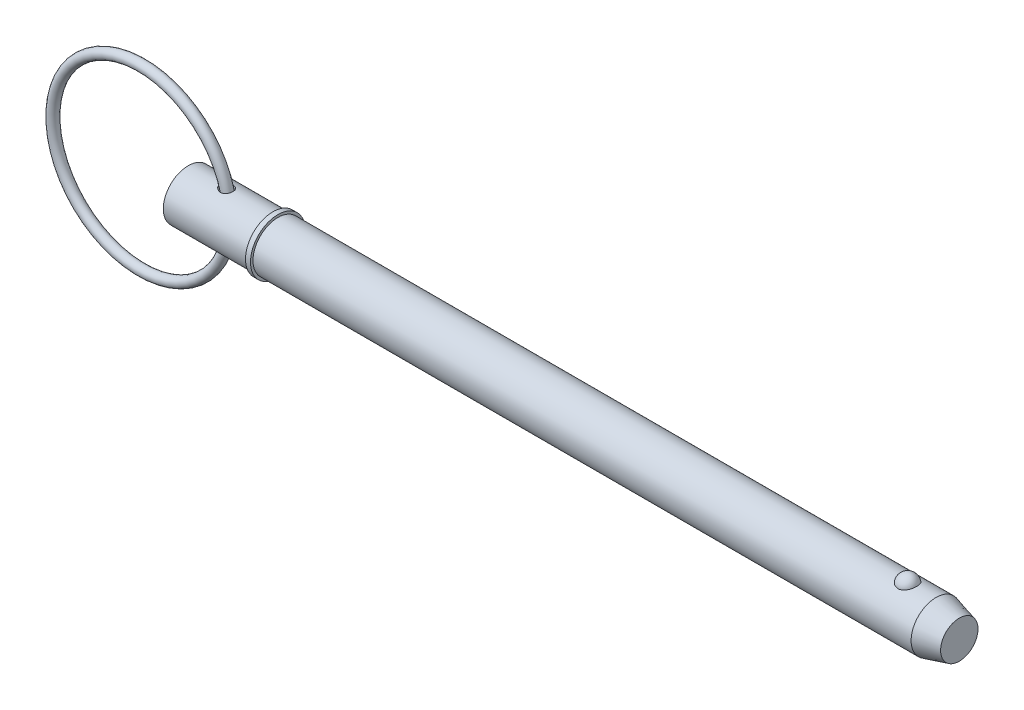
ISO-10303-21;
HEADER;
FILE_DESCRIPTION(('STEP AP214'),'2;1');
FILE_NAME('part.step','',(''),(''),'','','');
FILE_SCHEMA(('AUTOMOTIVE_DESIGN { 1 0 10303 214 1 1 1 1 }'));
ENDSEC;
DATA;
#1=APPLICATION_CONTEXT('core data for automotive mechanical design processes');
#2=APPLICATION_PROTOCOL_DEFINITION('international standard','automotive_design',2000,#1);
#3=PRODUCT_CONTEXT('',#1,'mechanical');
#4=PRODUCT('Part','Part','',(#3));
#5=PRODUCT_RELATED_PRODUCT_CATEGORY('part','',(#4));
#6=PRODUCT_DEFINITION_FORMATION('','',#4);
#7=PRODUCT_DEFINITION_CONTEXT('part definition',#1,'design');
#8=PRODUCT_DEFINITION('design','',#6,#7);
#9=PRODUCT_DEFINITION_SHAPE('','',#8);
#10=(LENGTH_UNIT() NAMED_UNIT(*) SI_UNIT(.MILLI.,.METRE.));
#11=(NAMED_UNIT(*) PLANE_ANGLE_UNIT() SI_UNIT($,.RADIAN.));
#12=(NAMED_UNIT(*) SI_UNIT($,.STERADIAN.) SOLID_ANGLE_UNIT());
#13=UNCERTAINTY_MEASURE_WITH_UNIT(LENGTH_MEASURE(1.E-05),#10,'distance_accuracy_value','');
#14=(GEOMETRIC_REPRESENTATION_CONTEXT(3) GLOBAL_UNCERTAINTY_ASSIGNED_CONTEXT((#13)) GLOBAL_UNIT_ASSIGNED_CONTEXT((#10,
#11,#12)) REPRESENTATION_CONTEXT('',''));
#15=CARTESIAN_POINT('',(0.,0.,0.));
#16=DIRECTION('',(0.,0.,1.));
#17=DIRECTION('',(1.,0.,0.));
#18=AXIS2_PLACEMENT_3D('',#15,#16,#17);
#19=CARTESIAN_POINT('',(-13.3805387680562,0.,0.));
#20=DIRECTION('',(0.,0.,1.));
#21=DIRECTION('',(1.,0.,0.));
#22=AXIS2_PLACEMENT_3D('',#19,#20,#21);
#23=TOROIDAL_SURFACE('',#22,25.4,1.429);
#24=CARTESIAN_POINT('',(13.4484612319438,0.,0.));
#25=VERTEX_POINT('',#24);
#26=VERTEX_LOOP('',#25);
#27=FACE_BOUND('',#26,.T.);
#28=ADVANCED_FACE('P0_F12',(#27),#23,.T.);
#29=CLOSED_SHELL('',(#28));
#30=MANIFOLD_SOLID_BREP('P0_B1',#29);
#31=CARTESIAN_POINT('',(0.,0.,0.));
#32=DIRECTION('',(1.,0.,0.));
#33=DIRECTION('',(0.,0.,-1.));
#34=AXIS2_PLACEMENT_3D('',#31,#32,#33);
#35=CYLINDRICAL_SURFACE('',#34,7.145);
#36=CARTESIAN_POINT('',(9.43029029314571,7.0820748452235,-0.946171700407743));
#37=CARTESIAN_POINT('',(9.49289741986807,7.07004660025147,-1.03619677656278));
#38=CARTESIAN_POINT('',(9.56370593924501,7.05703049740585,-1.12049617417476));
#39=CARTESIAN_POINT('',(9.71869321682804,7.03060933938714,-1.27585605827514));
#40=CARTESIAN_POINT('',(9.80290151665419,7.01720347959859,-1.34688652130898));
#41=CARTESIAN_POINT('',(9.98160385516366,6.99158714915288,-1.47408585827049));
#42=CARTESIAN_POINT('',(10.0760626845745,6.97937284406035,-1.53030346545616));
#43=CARTESIAN_POINT('',(10.2729508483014,6.95747410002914,-1.62697341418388));
#44=CARTESIAN_POINT('',(10.3753769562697,6.9477886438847,-1.66743209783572));
#45=CARTESIAN_POINT('',(10.5898946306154,6.93181594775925,-1.73266776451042));
#46=CARTESIAN_POINT('',(10.7022085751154,6.92567913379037,-1.75675727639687));
#47=CARTESIAN_POINT('',(10.9294935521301,6.91839634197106,-1.78523005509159));
#48=CARTESIAN_POINT('',(11.0444638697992,6.91724903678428,-1.78961856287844));
#49=CARTESIAN_POINT('',(11.2673249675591,6.92023954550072,-1.77801517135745));
#50=CARTESIAN_POINT('',(11.3752729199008,6.9241055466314,-1.7630715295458));
#51=CARTESIAN_POINT('',(11.5865707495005,6.93632220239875,-1.71437618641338));
#52=CARTESIAN_POINT('',(11.6899227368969,6.94467077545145,-1.68063321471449));
#53=CARTESIAN_POINT('',(11.8814537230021,6.96412118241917,-1.59802791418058));
#54=CARTESIAN_POINT('',(11.9701885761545,6.97498839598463,-1.55039425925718));
#55=CARTESIAN_POINT('',(12.1379548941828,6.99847346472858,-1.44066970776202));
#56=CARTESIAN_POINT('',(12.216987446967,7.01109112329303,-1.37858043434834));
#57=CARTESIAN_POINT('',(12.3614636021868,7.03632910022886,-1.24326778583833));
#58=CARTESIAN_POINT('',(12.4271729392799,7.04894297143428,-1.17032635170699));
#59=CARTESIAN_POINT('',(12.5455377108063,7.07306867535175,-1.01436746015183));
#60=CARTESIAN_POINT('',(12.5981928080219,7.08458047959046,-0.931349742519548));
#61=CARTESIAN_POINT('',(12.6896059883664,7.10535787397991,-0.75677050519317));
#62=CARTESIAN_POINT('',(12.7282356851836,7.11460247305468,-0.665139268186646));
#63=CARTESIAN_POINT('',(12.7900431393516,7.12971795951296,-0.476541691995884));
#64=CARTESIAN_POINT('',(12.8132203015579,7.13558871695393,-0.379575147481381));
#65=CARTESIAN_POINT('',(12.843715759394,7.14336270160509,-0.182249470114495));
#66=CARTESIAN_POINT('',(12.8509095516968,7.14523477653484,-0.0818698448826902));
#67=CARTESIAN_POINT('',(12.8489064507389,7.14471772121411,0.11871563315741));
#68=CARTESIAN_POINT('',(12.8397092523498,7.14232851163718,0.218921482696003));
#69=CARTESIAN_POINT('',(12.8051110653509,7.13353949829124,0.416446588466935));
#70=CARTESIAN_POINT('',(12.7796895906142,7.12713462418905,0.51376203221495));
#71=CARTESIAN_POINT('',(12.7132079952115,7.1110024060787,0.702607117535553));
#72=CARTESIAN_POINT('',(12.6721476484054,7.10127501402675,0.794136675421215));
#73=CARTESIAN_POINT('',(12.5754142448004,7.07957648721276,0.9686879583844));
#74=CARTESIAN_POINT('',(12.5197583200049,7.06760798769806,1.05171950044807));
#75=CARTESIAN_POINT('',(12.3951873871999,7.04275315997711,1.20699878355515));
#76=CARTESIAN_POINT('',(12.3262733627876,7.02986689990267,1.27924732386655));
#77=CARTESIAN_POINT('',(12.1775943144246,7.00473797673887,1.41035599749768));
#78=CARTESIAN_POINT('',(12.0979195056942,6.99249102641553,1.46931758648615));
#79=CARTESIAN_POINT('',(11.9295314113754,6.96991222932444,1.57295053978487));
#80=CARTESIAN_POINT('',(11.840819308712,6.9595801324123,1.61762377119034));
#81=CARTESIAN_POINT('',(11.6577653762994,6.94204625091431,1.69128599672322));
#82=CARTESIAN_POINT('',(11.5634812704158,6.93481718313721,1.72041226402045));
#83=CARTESIAN_POINT('',(11.3712731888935,6.92407027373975,1.76316901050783));
#84=CARTESIAN_POINT('',(11.2733489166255,6.92055273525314,1.7767982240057));
#85=CARTESIAN_POINT('',(11.0745092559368,6.91745053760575,1.78883853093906));
#86=CARTESIAN_POINT('',(10.9735737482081,6.91794816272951,1.7869312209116));
#87=CARTESIAN_POINT('',(10.7732766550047,6.92286647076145,1.76777696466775));
#88=CARTESIAN_POINT('',(10.6739155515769,6.92728833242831,1.75052540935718));
#89=CARTESIAN_POINT('',(10.4726907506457,6.93987626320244,1.69995986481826));
#90=CARTESIAN_POINT('',(10.3710860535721,6.94826759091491,1.66567223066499));
#91=CARTESIAN_POINT('',(10.1746512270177,6.96783543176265,1.5818155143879));
#92=CARTESIAN_POINT('',(10.0798244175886,6.97901329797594,1.53223900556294));
#93=CARTESIAN_POINT('',(9.89353725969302,7.00369413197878,1.41530336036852));
#94=CARTESIAN_POINT('',(9.80266896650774,7.01729943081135,1.34701798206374));
#95=CARTESIAN_POINT('',(9.63408859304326,7.0446567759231,1.19571433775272));
#96=CARTESIAN_POINT('',(9.55637809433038,7.05840883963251,1.11269430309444));
#97=CARTESIAN_POINT('',(9.41909992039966,7.083998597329,0.935821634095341));
#98=CARTESIAN_POINT('',(9.3591283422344,7.09587546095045,0.842290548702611));
#99=CARTESIAN_POINT('',(9.25811978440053,7.11649414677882,0.645207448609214));
#100=CARTESIAN_POINT('',(9.2170578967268,7.12524008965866,0.541668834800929));
#101=CARTESIAN_POINT('',(9.16044503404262,7.13745944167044,0.341322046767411));
#102=CARTESIAN_POINT('',(9.14237352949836,7.14144984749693,0.24525723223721));
#103=CARTESIAN_POINT('',(9.12416132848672,7.14547143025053,0.0513577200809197));
#104=CARTESIAN_POINT('',(9.12401221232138,7.14550446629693,-0.0464761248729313));
#105=CARTESIAN_POINT('',(9.14075660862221,7.14180686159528,-0.230866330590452));
#106=CARTESIAN_POINT('',(9.15598246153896,7.13844450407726,-0.317588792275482));
#107=CARTESIAN_POINT('',(9.20015637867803,7.1288735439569,-0.487231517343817));
#108=CARTESIAN_POINT('',(9.22909411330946,7.12266708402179,-0.570154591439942));
#109=CARTESIAN_POINT('',(9.2869632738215,7.11060500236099,-0.702183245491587));
#110=CARTESIAN_POINT('',(9.31233771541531,7.10538970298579,-0.752949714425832));
#111=CARTESIAN_POINT('',(9.36784352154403,7.09422889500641,-0.85170964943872));
#112=CARTESIAN_POINT('',(9.39797435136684,7.08828346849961,-0.899703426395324));
#113=CARTESIAN_POINT('',(9.43029029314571,7.0820748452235,-0.946171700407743));
#114=B_SPLINE_CURVE_WITH_KNOTS('',3,(#36,#37,#38,#39,#40,#41,#42,#43,#44,#45,#46,#47,#48,#49,
#50,#51,#52,#53,#54,#55,#56,#57,#58,#59,#60,#61,#62,#63,#64,#65,#66,#67,#68,#69,#70,#71,#72,#73,
#74,#75,#76,#77,#78,#79,#80,#81,#82,#83,#84,#85,#86,#87,#88,#89,#90,#91,#92,#93,#94,#95,#96,#97,
#98,#99,#100,#101,#102,#103,#104,#105,#106,#107,#108,#109,#110,#111,#112,#113),.UNSPECIFIED.,
.T.,.F.,(4,2,2,2,2,2,2,2,2,2,2,2,2,2,2,2,2,2,2,2,2,2,2,2,2,2,2,2,2,2,2,2,2,2,2,2,2,2,4),(0.,
0.330712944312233,0.662165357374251,0.992513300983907,1.32272815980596,1.66607248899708,
2.00932547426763,2.33472339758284,2.65997034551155,2.96236844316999,3.26473260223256,
3.56029376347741,3.85586255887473,4.15407251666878,4.45229395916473,4.75283038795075,
5.05337241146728,5.35429467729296,5.6552212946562,5.95579625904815,6.25634893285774,
6.55452242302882,6.85265693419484,7.14811357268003,7.44359434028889,7.74514565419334,
8.04678757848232,8.368090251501,8.68954924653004,9.03133562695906,9.37316306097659,
9.70647113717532,10.0393389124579,10.3311793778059,10.6228827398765,10.8860177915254,
11.1489549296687,11.3196783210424,11.4903825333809),.UNSPECIFIED.);
#115=CARTESIAN_POINT('',(9.43029029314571,7.0820748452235,-0.946171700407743));
#116=VERTEX_POINT('',#115);
#117=EDGE_CURVE('P1_E42',#116,#116,#114,.T.);
#118=ORIENTED_EDGE('',*,*,#117,.T.);
#119=EDGE_LOOP('',(#118));
#120=FACE_BOUND('',#119,.T.);
#121=CARTESIAN_POINT('',(0.,0.,0.));
#122=DIRECTION('',(1.,0.,0.));
#123=DIRECTION('',(0.,0.,-1.));
#124=AXIS2_PLACEMENT_3D('',#121,#122,#123);
#125=CIRCLE('',#124,7.145);
#126=CARTESIAN_POINT('',(0.,0.,-7.145));
#127=VERTEX_POINT('',#126);
#128=EDGE_CURVE('P1_E9',#127,#127,#125,.T.);
#129=ORIENTED_EDGE('',*,*,#128,.T.);
#130=EDGE_LOOP('',(#129));
#131=FACE_BOUND('',#130,.T.);
#132=CARTESIAN_POINT('',(24.271,0.,0.));
#133=DIRECTION('',(1.,0.,0.));
#134=DIRECTION('',(0.,0.,-1.));
#135=AXIS2_PLACEMENT_3D('',#132,#133,#134);
#136=CIRCLE('',#135,7.145);
#137=CARTESIAN_POINT('',(24.271,0.,-7.145));
#138=VERTEX_POINT('',#137);
#139=EDGE_CURVE('P1_E25',#138,#138,#136,.T.);
#140=ORIENTED_EDGE('',*,*,#139,.F.);
#141=EDGE_LOOP('',(#140));
#142=FACE_BOUND('',#141,.T.);
#143=CARTESIAN_POINT('',(9.43029029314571,-7.0820748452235,-0.946171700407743));
#144=CARTESIAN_POINT('',(9.37760063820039,-7.09219753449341,-0.870403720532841));
#145=CARTESIAN_POINT('',(9.33068640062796,-7.10162619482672,-0.790535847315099));
#146=CARTESIAN_POINT('',(9.25028000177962,-7.11818229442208,-0.624083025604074));
#147=CARTESIAN_POINT('',(9.21677847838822,-7.12531133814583,-0.537502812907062));
#148=CARTESIAN_POINT('',(9.16475883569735,-7.13651886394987,-0.359324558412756));
#149=CARTESIAN_POINT('',(9.14630423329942,-7.14058440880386,-0.267706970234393));
#150=CARTESIAN_POINT('',(9.12573334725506,-7.14512216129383,-0.0825612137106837));
#151=CARTESIAN_POINT('',(9.12361335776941,-7.1455951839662,0.0109665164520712));
#152=CARTESIAN_POINT('',(9.13548667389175,-7.14296952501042,0.191627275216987));
#153=CARTESIAN_POINT('',(9.14858103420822,-7.14007009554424,0.278824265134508));
#154=CARTESIAN_POINT('',(9.18869656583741,-7.1313430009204,0.449782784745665));
#155=CARTESIAN_POINT('',(9.21571947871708,-7.1255149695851,0.533543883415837));
#156=CARTESIAN_POINT('',(9.282939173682,-7.11140544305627,0.696984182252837));
#157=CARTESIAN_POINT('',(9.32334793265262,-7.10308469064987,0.7765721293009));
#158=CARTESIAN_POINT('',(9.41555290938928,-7.08481187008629,0.928623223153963));
#159=CARTESIAN_POINT('',(9.4673531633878,-7.07485922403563,1.00108383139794));
#160=CARTESIAN_POINT('',(9.58690514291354,-7.05302654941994,1.14530893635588));
#161=CARTESIAN_POINT('',(9.65578345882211,-7.04105486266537,1.21612477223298));
#162=CARTESIAN_POINT('',(9.80342908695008,-7.01727063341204,1.34660507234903));
#163=CARTESIAN_POINT('',(9.88220203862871,-7.00545818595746,1.40626312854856));
#164=CARTESIAN_POINT('',(10.0573217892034,-6.98177399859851,1.51973713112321));
#165=CARTESIAN_POINT('',(10.1546474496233,-6.9700532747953,1.57208037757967));
#166=CARTESIAN_POINT('',(10.3567277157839,-6.94950828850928,1.66055104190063));
#167=CARTESIAN_POINT('',(10.4614845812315,-6.94068491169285,1.69667350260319));
#168=CARTESIAN_POINT('',(10.6792116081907,-6.92685379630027,1.75230777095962));
#169=CARTESIAN_POINT('',(10.7923373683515,-6.92197732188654,1.77125049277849));
#170=CARTESIAN_POINT('',(11.0202699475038,-6.91736328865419,1.78919210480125));
#171=CARTESIAN_POINT('',(11.1350759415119,-6.91762328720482,1.78820047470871));
#172=CARTESIAN_POINT('',(11.355627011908,-6.92328130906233,1.76615765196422));
#173=CARTESIAN_POINT('',(11.4615007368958,-6.92836826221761,1.74632083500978));
#174=CARTESIAN_POINT('',(11.6678083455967,-6.94272508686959,1.68833625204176));
#175=CARTESIAN_POINT('',(11.7682443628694,-6.9519933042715,1.65019572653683));
#176=CARTESIAN_POINT('',(11.9539217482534,-6.97285816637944,1.55957439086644));
#177=CARTESIAN_POINT('',(12.0397280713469,-6.98426147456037,1.50820229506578));
#178=CARTESIAN_POINT('',(12.2011249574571,-7.00842344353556,1.39160266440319));
#179=CARTESIAN_POINT('',(12.276716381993,-7.0211819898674,1.32637629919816));
#180=CARTESIAN_POINT('',(12.4144868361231,-7.04639315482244,1.18508369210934));
#181=CARTESIAN_POINT('',(12.4768620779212,-7.05884739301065,1.10920872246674));
#182=CARTESIAN_POINT('',(12.5881779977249,-7.08230185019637,0.947973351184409));
#183=CARTESIAN_POINT('',(12.6371182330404,-7.09330202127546,0.862612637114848));
#184=CARTESIAN_POINT('',(12.7208404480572,-7.11277016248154,0.68387168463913));
#185=CARTESIAN_POINT('',(12.7554736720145,-7.12121129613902,0.590418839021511));
#186=CARTESIAN_POINT('',(12.8090653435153,-7.13450309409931,0.398877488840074));
#187=CARTESIAN_POINT('',(12.8280232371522,-7.13935363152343,0.300788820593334));
#188=CARTESIAN_POINT('',(12.8499077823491,-7.14496695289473,0.102058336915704));
#189=CARTESIAN_POINT('',(12.8527265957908,-7.14570223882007,0.00140385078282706));
#190=CARTESIAN_POINT('',(12.8419792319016,-7.14293198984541,-0.198968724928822));
#191=CARTESIAN_POINT('',(12.8284127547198,-7.13942637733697,-0.298686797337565));
#192=CARTESIAN_POINT('',(12.7851853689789,-7.12854635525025,-0.494442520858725));
#193=CARTESIAN_POINT('',(12.7555107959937,-7.12116866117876,-0.590476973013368));
#194=CARTESIAN_POINT('',(12.6807437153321,-7.10334272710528,-0.776042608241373));
#195=CARTESIAN_POINT('',(12.6356510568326,-7.09289445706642,-0.865573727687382));
#196=CARTESIAN_POINT('',(12.5312128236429,-7.07009703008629,-1.03541867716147));
#197=CARTESIAN_POINT('',(12.4718917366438,-7.0577511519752,-1.11574799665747));
#198=CARTESIAN_POINT('',(12.3404461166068,-7.03252701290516,-1.26504204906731));
#199=CARTESIAN_POINT('',(12.2683227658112,-7.01964880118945,-1.3340078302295));
#200=CARTESIAN_POINT('',(12.1139052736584,-6.99493588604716,-1.45803732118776));
#201=CARTESIAN_POINT('',(12.031708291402,-6.98309284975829,-1.51322032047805));
#202=CARTESIAN_POINT('',(11.858962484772,-6.96164945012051,-1.60900039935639));
#203=CARTESIAN_POINT('',(11.7684146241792,-6.95204882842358,-1.6495991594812));
#204=CARTESIAN_POINT('',(11.5822744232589,-6.93618392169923,-1.71508374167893));
#205=CARTESIAN_POINT('',(11.4867225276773,-6.92989640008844,-1.74007923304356));
#206=CARTESIAN_POINT('',(11.292703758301,-6.92114809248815,-1.77455680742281));
#207=CARTESIAN_POINT('',(11.1942365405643,-6.91868775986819,-1.7840370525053));
#208=CARTESIAN_POINT('',(10.9943797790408,-6.91771041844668,-1.78782317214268));
#209=CARTESIAN_POINT('',(10.8929824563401,-6.9193005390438,-1.78171679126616));
#210=CARTESIAN_POINT('',(10.6924353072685,-6.92632816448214,-1.75419409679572));
#211=CARTESIAN_POINT('',(10.5932861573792,-6.93176681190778,-1.73277323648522));
#212=CARTESIAN_POINT('',(10.3927770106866,-6.94630717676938,-1.67356884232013));
#213=CARTESIAN_POINT('',(10.2917367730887,-6.95563581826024,-1.63475796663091));
#214=CARTESIAN_POINT('',(10.0971768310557,-6.97681957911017,-1.54184188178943));
#215=CARTESIAN_POINT('',(10.0036623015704,-6.9886764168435,-1.48772626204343));
#216=CARTESIAN_POINT('',(9.82098935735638,-7.01440230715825,-1.36146688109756));
#217=CARTESIAN_POINT('',(9.73247440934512,-7.0283510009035,-1.28840361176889));
#218=CARTESIAN_POINT('',(9.56978695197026,-7.05591334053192,-1.12770855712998));
#219=CARTESIAN_POINT('',(9.49560170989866,-7.06952727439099,-1.0400898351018));
#220=CARTESIAN_POINT('',(9.43029029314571,-7.0820748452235,-0.946171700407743));
#221=B_SPLINE_CURVE_WITH_KNOTS('',3,(#143,#144,#145,#146,#147,#148,#149,#150,#151,#152,#153,
#154,#155,#156,#157,#158,#159,#160,#161,#162,#163,#164,#165,#166,#167,#168,#169,#170,#171,#172,
#173,#174,#175,#176,#177,#178,#179,#180,#181,#182,#183,#184,#185,#186,#187,#188,#189,#190,#191,
#192,#193,#194,#195,#196,#197,#198,#199,#200,#201,#202,#203,#204,#205,#206,#207,#208,#209,#210,
#211,#212,#213,#214,#215,#216,#217,#218,#219,#220),.UNSPECIFIED.,.T.,.F.,(4,2,2,2,2,2,2,2,2,2,2,
2,2,2,2,2,2,2,2,2,2,2,2,2,2,2,2,2,2,2,2,2,2,2,2,2,2,2,4),(0.,0.278197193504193,
0.556199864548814,0.835370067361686,1.11447693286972,1.37789669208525,1.64134939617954,
1.9091912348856,2.17712812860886,2.4744625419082,2.77196719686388,3.10386520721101,
3.43586457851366,3.77849767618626,4.1209678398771,4.44276705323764,4.76443907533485,
5.06494526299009,5.36542609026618,5.6610728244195,5.95672929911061,6.25538683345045,
6.5540549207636,6.85471634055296,7.15538326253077,7.45630563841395,7.75723095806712,
8.05764204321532,8.35802540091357,8.65571107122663,8.95336242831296,9.24889743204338,
9.54446744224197,9.84793560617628,10.1514939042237,10.4760045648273,10.8007364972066,
11.1458836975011,11.4907227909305),.UNSPECIFIED.);
#222=CARTESIAN_POINT('',(9.43029029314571,-7.0820748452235,-0.946171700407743));
#223=VERTEX_POINT('',#222);
#224=EDGE_CURVE('P1_E17',#223,#223,#221,.T.);
#225=ORIENTED_EDGE('',*,*,#224,.T.);
#226=EDGE_LOOP('',(#225));
#227=FACE_BOUND('',#226,.T.);
#228=ADVANCED_FACE('P1_F13',(#120,#131,#142,#227),#35,.T.);
#229=CARTESIAN_POINT('',(0.,0.,0.));
#230=DIRECTION('',(1.,0.,0.));
#231=DIRECTION('',(0.,0.,-1.));
#232=AXIS2_PLACEMENT_3D('',#229,#230,#231);
#233=CYLINDRICAL_SURFACE('',#232,7.145);
#234=CARTESIAN_POINT('',(214.28362424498,0.,0.));
#235=DIRECTION('',(1.,0.,0.));
#236=DIRECTION('',(0.,0.,-1.));
#237=AXIS2_PLACEMENT_3D('',#234,#235,#236);
#238=CIRCLE('',#237,7.145);
#239=CARTESIAN_POINT('',(214.28362424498,0.,-7.145));
#240=VERTEX_POINT('',#239);
#241=EDGE_CURVE('P1_E99',#240,#240,#238,.T.);
#242=ORIENTED_EDGE('',*,*,#241,.F.);
#243=EDGE_LOOP('',(#242));
#244=FACE_BOUND('',#243,.T.);
#245=CARTESIAN_POINT('',(25.7,0.,0.));
#246=DIRECTION('',(1.,0.,0.));
#247=DIRECTION('',(0.,0.,-1.));
#248=AXIS2_PLACEMENT_3D('',#245,#246,#247);
#249=CIRCLE('',#248,7.145);
#250=CARTESIAN_POINT('',(25.7,0.,-7.145));
#251=VERTEX_POINT('',#250);
#252=EDGE_CURVE('P1_E96',#251,#251,#249,.T.);
#253=ORIENTED_EDGE('',*,*,#252,.T.);
#254=EDGE_LOOP('',(#253));
#255=FACE_BOUND('',#254,.T.);
#256=CARTESIAN_POINT('',(206.139503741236,6.60328629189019,2.72903557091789));
#257=CARTESIAN_POINT('',(205.998315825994,6.60329644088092,2.72902496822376));
#258=CARTESIAN_POINT('',(205.856883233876,6.60799490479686,2.71772840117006));
#259=CARTESIAN_POINT('',(205.577955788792,6.62628236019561,2.67281935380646));
#260=CARTESIAN_POINT('',(205.440472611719,6.63989534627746,2.63914664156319));
#261=CARTESIAN_POINT('',(205.173889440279,6.67440775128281,2.55059642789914));
#262=CARTESIAN_POINT('',(205.044768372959,6.69528793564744,2.49577486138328));
#263=CARTESIAN_POINT('',(204.797869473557,6.7420558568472,2.36651799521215));
#264=CARTESIAN_POINT('',(204.680086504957,6.76794130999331,2.29209163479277));
#265=CARTESIAN_POINT('',(204.45516710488,6.82286177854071,2.12312937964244));
#266=CARTESIAN_POINT('',(204.348440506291,6.85196655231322,2.02807107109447));
#267=CARTESIAN_POINT('',(204.151918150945,6.90970232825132,1.82167822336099));
#268=CARTESIAN_POINT('',(204.062127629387,6.93833318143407,1.7103386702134));
#269=CARTESIAN_POINT('',(203.897667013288,6.99351679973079,1.46891951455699));
#270=CARTESIAN_POINT('',(203.823844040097,7.01992110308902,1.33822781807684));
#271=CARTESIAN_POINT('',(203.698088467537,7.06643385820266,1.06566567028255));
#272=CARTESIAN_POINT('',(203.64615735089,7.08654188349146,0.923794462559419));
#273=CARTESIAN_POINT('',(203.564732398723,7.11862399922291,0.630993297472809));
#274=CARTESIAN_POINT('',(203.535516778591,7.13049704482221,0.479974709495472));
#275=CARTESIAN_POINT('',(203.501174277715,7.14449484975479,0.174782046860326));
#276=CARTESIAN_POINT('',(203.496046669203,7.14661990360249,0.0206080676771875));
#277=CARTESIAN_POINT('',(203.509938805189,7.14092465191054,-0.285506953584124));
#278=CARTESIAN_POINT('',(203.528810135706,7.1331654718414,-0.437455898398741));
#279=CARTESIAN_POINT('',(203.590062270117,7.10859076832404,-0.735778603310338));
#280=CARTESIAN_POINT('',(203.632443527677,7.0917750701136,-0.882152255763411));
#281=CARTESIAN_POINT('',(203.739934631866,7.05076716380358,-1.16543149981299));
#282=CARTESIAN_POINT('',(203.805075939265,7.02656475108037,-1.30232366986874));
#283=CARTESIAN_POINT('',(203.956759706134,6.97329145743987,-1.56265907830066));
#284=CARTESIAN_POINT('',(204.043303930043,6.94422017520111,-1.68610120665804));
#285=CARTESIAN_POINT('',(204.236465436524,6.88415108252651,-1.91671004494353));
#286=CARTESIAN_POINT('',(204.343180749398,6.85314438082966,-2.02379244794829));
#287=CARTESIAN_POINT('',(204.573974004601,6.7928206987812,-2.2178743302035));
#288=CARTESIAN_POINT('',(204.698050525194,6.76350358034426,-2.30487545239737));
#289=CARTESIAN_POINT('',(204.957678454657,6.71060580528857,-2.45458647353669));
#290=CARTESIAN_POINT('',(205.092938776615,6.68691885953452,-2.51776240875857));
#291=CARTESIAN_POINT('',(205.373277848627,6.64741247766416,-2.62030218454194));
#292=CARTESIAN_POINT('',(205.518352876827,6.63159007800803,-2.65967499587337));
#293=CARTESIAN_POINT('',(205.806347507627,6.61038594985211,-2.71193301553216));
#294=CARTESIAN_POINT('',(205.94900807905,6.6045188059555,-2.72605165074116));
#295=CARTESIAN_POINT('',(206.23480047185,6.60240611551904,-2.73116688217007));
#296=CARTESIAN_POINT('',(206.377932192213,6.60615862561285,-2.72216814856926));
#297=CARTESIAN_POINT('',(206.655848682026,6.62256094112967,-2.68200435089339));
#298=CARTESIAN_POINT('',(206.790754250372,6.63492533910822,-2.65154998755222));
#299=CARTESIAN_POINT('',(207.05332009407,6.66687445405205,-2.57015684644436));
#300=CARTESIAN_POINT('',(207.18097978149,6.68645975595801,-2.51921640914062));
#301=CARTESIAN_POINT('',(207.428577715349,6.73127274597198,-2.39693610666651));
#302=CARTESIAN_POINT('',(207.548287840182,6.75661381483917,-2.32517694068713));
#303=CARTESIAN_POINT('',(207.774159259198,6.81006003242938,-2.16363812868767));
#304=CARTESIAN_POINT('',(207.880317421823,6.83816581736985,-2.0738543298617));
#305=CARTESIAN_POINT('',(208.081862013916,6.89580469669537,-1.8735723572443));
#306=CARTESIAN_POINT('',(208.176440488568,6.92533863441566,-1.76226074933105));
#307=CARTESIAN_POINT('',(208.346332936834,6.98139526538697,-1.52511696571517));
#308=CARTESIAN_POINT('',(208.421643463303,7.00791741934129,-1.39928219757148));
#309=CARTESIAN_POINT('',(208.553595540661,7.0560762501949,-1.13215977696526));
#310=CARTESIAN_POINT('',(208.609568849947,7.07753119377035,-0.990508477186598));
#311=CARTESIAN_POINT('',(208.698296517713,7.11222355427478,-0.699154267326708));
#312=CARTESIAN_POINT('',(208.731050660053,7.12546089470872,-0.549451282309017));
#313=CARTESIAN_POINT('',(208.772689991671,7.1423758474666,-0.246120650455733));
#314=CARTESIAN_POINT('',(208.781558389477,7.14604673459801,-0.0924903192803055));
#315=CARTESIAN_POINT('',(208.77519405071,7.14343510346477,0.214181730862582));
#316=CARTESIAN_POINT('',(208.759961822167,7.13715279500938,0.367223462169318));
#317=CARTESIAN_POINT('',(208.705845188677,7.11532948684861,0.667595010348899));
#318=CARTESIAN_POINT('',(208.667077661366,7.09983424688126,0.814949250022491));
#319=CARTESIAN_POINT('',(208.566770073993,7.06119140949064,1.10063221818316));
#320=CARTESIAN_POINT('',(208.505228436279,7.03804328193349,1.23896032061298));
#321=CARTESIAN_POINT('',(208.360207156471,6.98632429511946,1.5035230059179));
#322=CARTESIAN_POINT('',(208.276606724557,6.95772382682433,1.62968561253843));
#323=CARTESIAN_POINT('',(208.08938046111,6.89823072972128,1.86554304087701));
#324=CARTESIAN_POINT('',(207.985755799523,6.86733823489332,1.97523882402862));
#325=CARTESIAN_POINT('',(207.761076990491,6.80676456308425,2.174822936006));
#326=CARTESIAN_POINT('',(207.640067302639,6.7770805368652,2.26476035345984));
#327=CARTESIAN_POINT('',(207.383340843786,6.72230501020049,2.42252989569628));
#328=CARTESIAN_POINT('',(207.24761851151,6.69721525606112,2.49035362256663));
#329=CARTESIAN_POINT('',(206.970402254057,6.65552591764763,2.5996764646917));
#330=CARTESIAN_POINT('',(206.829281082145,6.63865794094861,2.64202017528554));
#331=CARTESIAN_POINT('',(206.541444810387,6.61425039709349,2.70255841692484));
#332=CARTESIAN_POINT('',(206.394748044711,6.60668259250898,2.72082606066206));
#333=CARTESIAN_POINT('',(206.211679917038,6.6035875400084,2.72830331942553));
#334=CARTESIAN_POINT('',(206.175599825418,6.60328369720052,2.72903828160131));
#335=CARTESIAN_POINT('',(206.139503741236,6.60328629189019,2.72903557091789));
#336=B_SPLINE_CURVE_WITH_KNOTS('',3,(#256,#257,#258,#259,#260,#261,#262,#263,#264,#265,#266,
#267,#268,#269,#270,#271,#272,#273,#274,#275,#276,#277,#278,#279,#280,#281,#282,#283,#284,#285,
#286,#287,#288,#289,#290,#291,#292,#293,#294,#295,#296,#297,#298,#299,#300,#301,#302,#303,#304,
#305,#306,#307,#308,#309,#310,#311,#312,#313,#314,#315,#316,#317,#318,#319,#320,#321,#322,#323,
#324,#325,#326,#327,#328,#329,#330,#331,#332,#333,#334,#335),.UNSPECIFIED.,.T.,.F.,(4,2,2,2,2,2,
2,2,2,2,2,2,2,2,2,2,2,2,2,2,2,2,2,2,2,2,2,2,2,2,2,2,2,2,2,2,2,2,2,4),(0.,0.423468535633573,
0.848081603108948,1.27157926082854,1.69488414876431,2.13051395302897,2.5662781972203,
3.02136706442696,3.47648674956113,3.93709649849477,4.39769233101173,4.85545355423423,
5.31322361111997,5.77162895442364,6.23007210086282,6.69080337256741,7.15149693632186,
7.6026432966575,8.05361952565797,8.48189729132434,8.91008854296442,9.32472524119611,
9.73939553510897,10.1630783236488,10.5868588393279,11.0319070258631,11.4770347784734,
11.9362874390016,12.3955443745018,12.8551240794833,13.3146940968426,13.7720003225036,
14.2293382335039,14.6892343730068,15.1491036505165,15.6078171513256,16.0667046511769,
16.5093965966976,16.950741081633,17.0590049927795),.UNSPECIFIED.);
#337=CARTESIAN_POINT('',(206.139503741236,6.60328629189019,2.72903557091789));
#338=VERTEX_POINT('',#337);
#339=EDGE_CURVE('P1_E34',#338,#338,#336,.T.);
#340=ORIENTED_EDGE('',*,*,#339,.T.);
#341=EDGE_LOOP('',(#340));
#342=FACE_BOUND('',#341,.T.);
#343=ADVANCED_FACE('P1_F46',(#244,#255,#342),#233,.T.);
#344=CARTESIAN_POINT('',(0.,0.,0.));
#345=DIRECTION('',(-1.,0.,0.));
#346=DIRECTION('',(0.,0.,1.));
#347=AXIS2_PLACEMENT_3D('',#344,#345,#346);
#348=PLANE('',#347);
#349=ORIENTED_EDGE('',*,*,#128,.F.);
#350=EDGE_LOOP('',(#349));
#351=FACE_BOUND('',#350,.T.);
#352=ADVANCED_FACE('P1_F15',(#351),#348,.T.);
#353=CARTESIAN_POINT('',(24.271,7.145,0.));
#354=DIRECTION('',(-1.,0.,0.));
#355=DIRECTION('',(0.,0.,1.));
#356=AXIS2_PLACEMENT_3D('',#353,#354,#355);
#357=PLANE('',#356);
#358=ORIENTED_EDGE('',*,*,#139,.T.);
#359=EDGE_LOOP('',(#358));
#360=FACE_BOUND('',#359,.T.);
#361=CARTESIAN_POINT('',(24.271,0.,0.));
#362=DIRECTION('',(1.,0.,0.));
#363=DIRECTION('',(0.,0.,-1.));
#364=AXIS2_PLACEMENT_3D('',#361,#362,#363);
#365=CIRCLE('',#364,7.8595);
#366=CARTESIAN_POINT('',(24.271,0.,-7.8595));
#367=VERTEX_POINT('',#366);
#368=EDGE_CURVE('P1_E30',#367,#367,#365,.T.);
#369=ORIENTED_EDGE('',*,*,#368,.F.);
#370=EDGE_LOOP('',(#369));
#371=FACE_BOUND('',#370,.T.);
#372=ADVANCED_FACE('P1_F81',(#360,#371),#357,.T.);
#373=CARTESIAN_POINT('',(0.,0.,0.));
#374=DIRECTION('',(1.,0.,0.));
#375=DIRECTION('',(0.,0.,-1.));
#376=AXIS2_PLACEMENT_3D('',#373,#374,#375);
#377=CYLINDRICAL_SURFACE('',#376,7.8595);
#378=ORIENTED_EDGE('',*,*,#368,.T.);
#379=EDGE_LOOP('',(#378));
#380=FACE_BOUND('',#379,.T.);
#381=CARTESIAN_POINT('',(25.7,0.,0.));
#382=DIRECTION('',(1.,0.,0.));
#383=DIRECTION('',(0.,0.,-1.));
#384=AXIS2_PLACEMENT_3D('',#381,#382,#383);
#385=CIRCLE('',#384,7.8595);
#386=CARTESIAN_POINT('',(25.7,0.,-7.8595));
#387=VERTEX_POINT('',#386);
#388=EDGE_CURVE('P1_E95',#387,#387,#385,.T.);
#389=ORIENTED_EDGE('',*,*,#388,.F.);
#390=EDGE_LOOP('',(#389));
#391=FACE_BOUND('',#390,.T.);
#392=ADVANCED_FACE('P1_F68',(#380,#391),#377,.T.);
#393=CARTESIAN_POINT('',(25.7,7.8595,0.));
#394=DIRECTION('',(1.,0.,0.));
#395=DIRECTION('',(0.,0.,-1.));
#396=AXIS2_PLACEMENT_3D('',#393,#394,#395);
#397=PLANE('',#396);
#398=ORIENTED_EDGE('',*,*,#388,.T.);
#399=EDGE_LOOP('',(#398));
#400=FACE_BOUND('',#399,.T.);
#401=ORIENTED_EDGE('',*,*,#252,.F.);
#402=EDGE_LOOP('',(#401));
#403=FACE_BOUND('',#402,.T.);
#404=ADVANCED_FACE('P1_F62',(#400,#403),#397,.T.);
#405=CARTESIAN_POINT('',(220.95,0.,0.));
#406=DIRECTION('',(-1.,0.,0.));
#407=DIRECTION('',(0.,0.,1.));
#408=AXIS2_PLACEMENT_3D('',#405,#406,#407);
#409=CONICAL_SURFACE('',#408,5.35875000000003,0.26179938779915);
#410=ORIENTED_EDGE('',*,*,#241,.T.);
#411=EDGE_LOOP('',(#410));
#412=FACE_BOUND('',#411,.T.);
#413=CARTESIAN_POINT('',(220.95,0.,0.));
#414=DIRECTION('',(1.,0.,0.));
#415=DIRECTION('',(0.,0.,-1.));
#416=AXIS2_PLACEMENT_3D('',#413,#414,#415);
#417=CIRCLE('',#416,5.35875000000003);
#418=CARTESIAN_POINT('',(220.95,0.,-5.35875000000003));
#419=VERTEX_POINT('',#418);
#420=EDGE_CURVE('P1_E41',#419,#419,#417,.T.);
#421=ORIENTED_EDGE('',*,*,#420,.F.);
#422=EDGE_LOOP('',(#421));
#423=FACE_BOUND('',#422,.T.);
#424=ADVANCED_FACE('P1_F59',(#412,#423),#409,.T.);
#425=CARTESIAN_POINT('',(220.95,5.35875000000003,0.));
#426=DIRECTION('',(1.,0.,0.));
#427=DIRECTION('',(0.,0.,-1.));
#428=AXIS2_PLACEMENT_3D('',#425,#426,#427);
#429=PLANE('',#428);
#430=ORIENTED_EDGE('',*,*,#420,.T.);
#431=EDGE_LOOP('',(#430));
#432=FACE_BOUND('',#431,.T.);
#433=ADVANCED_FACE('P1_F55',(#432),#429,.T.);
#434=CARTESIAN_POINT('',(206.139503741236,6.4305,0.));
#435=DIRECTION('',(-1.,0.,0.));
#436=DIRECTION('',(0.,1.,0.));
#437=AXIS2_PLACEMENT_3D('',#434,#435,#436);
#438=SPHERICAL_SURFACE('',#437,2.73450000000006);
#439=ORIENTED_EDGE('',*,*,#339,.F.);
#440=EDGE_LOOP('',(#439));
#441=FACE_BOUND('',#440,.T.);
#442=ADVANCED_FACE('P1_F50',(#441),#438,.T.);
#443=CARTESIAN_POINT('',(-13.3805387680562,0.,0.));
#444=DIRECTION('',(0.,0.,1.));
#445=DIRECTION('',(1.,0.,0.));
#446=AXIS2_PLACEMENT_3D('',#443,#444,#445);
#447=TOROIDAL_SURFACE('',#446,25.4,1.78625);
#448=ORIENTED_EDGE('',*,*,#224,.F.);
#449=EDGE_LOOP('',(#448));
#450=FACE_BOUND('',#449,.T.);
#451=ORIENTED_EDGE('',*,*,#117,.F.);
#452=EDGE_LOOP('',(#451));
#453=FACE_BOUND('',#452,.T.);
#454=ADVANCED_FACE('P1_F54',(#450,#453),#447,.F.);
#455=CLOSED_SHELL('',(#228,#343,#352,#372,#392,#404,#424,#433,#442,#454));
#456=MANIFOLD_SOLID_BREP('P1_B1',#455);
#457=ADVANCED_BREP_SHAPE_REPRESENTATION('',(#18,#30,#456),#14);
#458=SHAPE_DEFINITION_REPRESENTATION(#9,#457);
ENDSEC;
END-ISO-10303-21;
